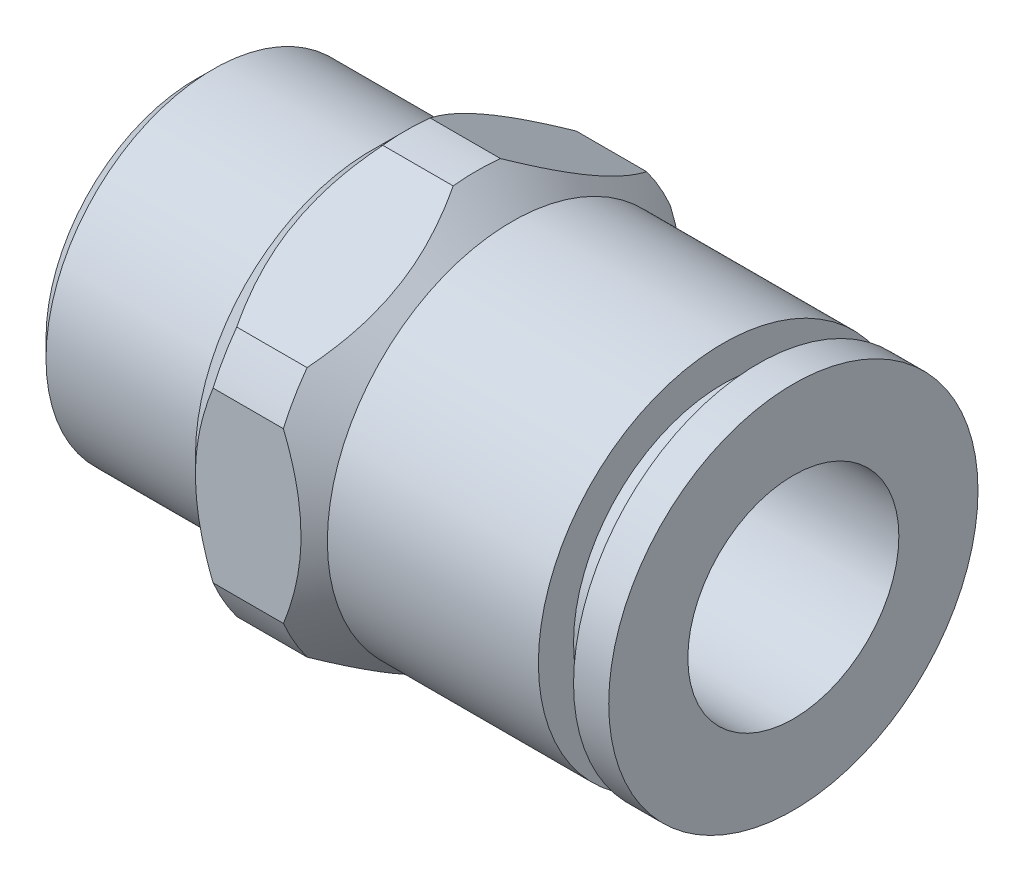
from build123d import *

# Parameters (mm, degrees)
ESQUISSE2_OUTSIDE_W     = 18.804
ESQUISSE2_OUTSIDE_H     = 18.804
ENL_V_MAT_EXTRU_1_DEPTH = 13.369316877


with BuildPart() as part:
    # Esquisse1 → Base-R_volution (revolve)
    with BuildSketch(Plane.XY, mode=Mode.PRIVATE) as base_r_volution_sk:
        Polygon((-10, 3), (-10, 4.25), (-9.5, 4.75), (-5, 4.75), (-5, 5), (-4, 6), (-2, 6), (-1, 5), (-1, 5.25), (5, 5.25), (5, 4.25), (6, 4.25), (6, 5.25), (7, 5.25), (7, 3), (0.5, 3), (0.5, 2.5), (-9.5, 2.5), align=None)
    revolve(base_r_volution_sk.sketch.rotate(Axis((-51.603797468, 0, 0), (1, 0, 0)), 90), axis=Axis((-51.603797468, 0, 0), (1, 0, 0)))

    # Esquisse2 outside → Enl_v. mat.-Extru.1 (cut, through all)
    with BuildSketch(Plane.ZY.offset(1)):
        Rectangle(ESQUISSE2_OUTSIDE_W, ESQUISSE2_OUTSIDE_H)
        Polygon((0, -6.350852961), (5.5, -3.175426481), (5.5, 3.175426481), (0, 6.350852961), (-5.5, 3.175426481), (-5.5, -3.175426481), align=None, mode=Mode.SUBTRACT)
    extrude(amount=ENL_V_MAT_EXTRU_1_DEPTH, mode=Mode.SUBTRACT)


solid = part.part
